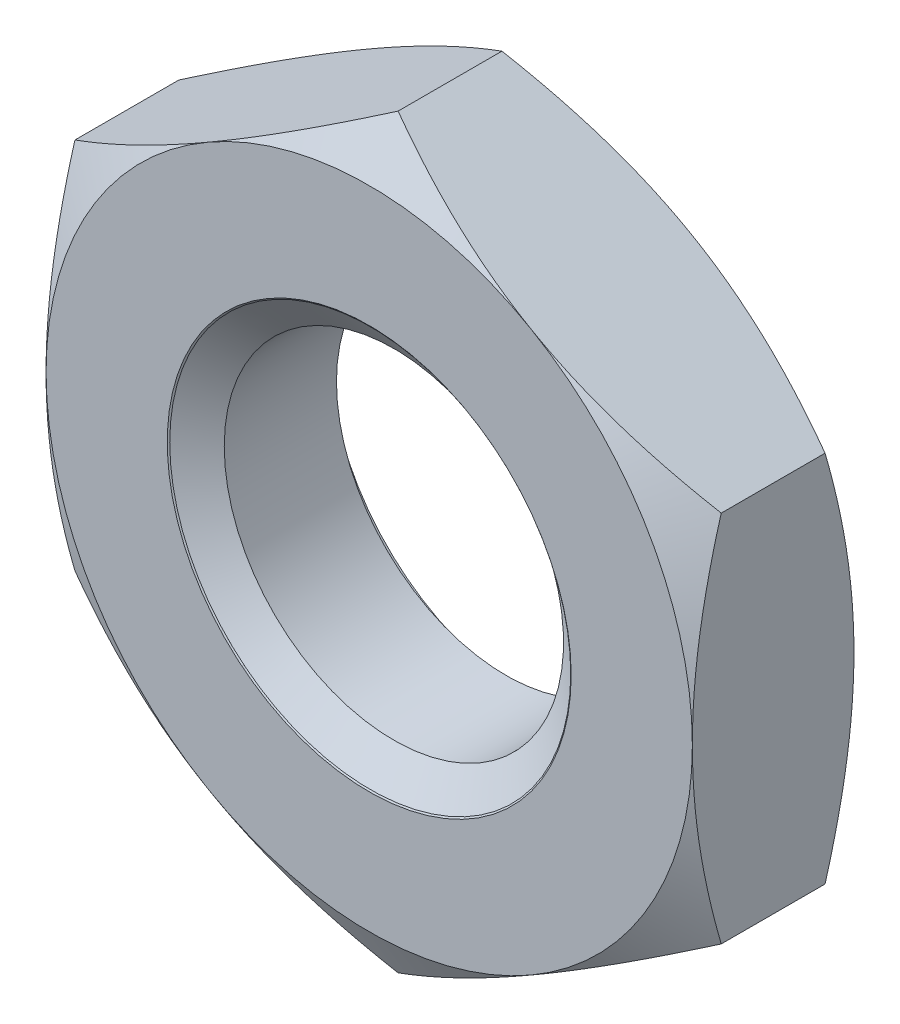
ISO-10303-21;
HEADER;
FILE_DESCRIPTION(('STEP AP214'),'2;1');
FILE_NAME('part.step','',(''),(''),'','','');
FILE_SCHEMA(('AUTOMOTIVE_DESIGN { 1 0 10303 214 1 1 1 1 }'));
ENDSEC;
DATA;
#1=APPLICATION_CONTEXT('core data for automotive mechanical design processes');
#2=APPLICATION_PROTOCOL_DEFINITION('international standard','automotive_design',2000,#1);
#3=PRODUCT_CONTEXT('',#1,'mechanical');
#4=PRODUCT('Part','Part','',(#3));
#5=PRODUCT_RELATED_PRODUCT_CATEGORY('part','',(#4));
#6=PRODUCT_DEFINITION_FORMATION('','',#4);
#7=PRODUCT_DEFINITION_CONTEXT('part definition',#1,'design');
#8=PRODUCT_DEFINITION('design','',#6,#7);
#9=PRODUCT_DEFINITION_SHAPE('','',#8);
#10=(LENGTH_UNIT() NAMED_UNIT(*) SI_UNIT(.MILLI.,.METRE.));
#11=(NAMED_UNIT(*) PLANE_ANGLE_UNIT() SI_UNIT($,.RADIAN.));
#12=(NAMED_UNIT(*) SI_UNIT($,.STERADIAN.) SOLID_ANGLE_UNIT());
#13=UNCERTAINTY_MEASURE_WITH_UNIT(LENGTH_MEASURE(1.E-05),#10,'distance_accuracy_value','');
#14=(GEOMETRIC_REPRESENTATION_CONTEXT(3) GLOBAL_UNCERTAINTY_ASSIGNED_CONTEXT((#13)) GLOBAL_UNIT_ASSIGNED_CONTEXT((#10,
#11,#12)) REPRESENTATION_CONTEXT('',''));
#15=CARTESIAN_POINT('',(0.,0.,0.));
#16=DIRECTION('',(0.,0.,1.));
#17=DIRECTION('',(1.,0.,0.));
#18=AXIS2_PLACEMENT_3D('',#15,#16,#17);
#19=CARTESIAN_POINT('',(0.,0.,-2.));
#20=DIRECTION('',(0.,0.,1.));
#21=DIRECTION('',(1.,0.,0.));
#22=AXIS2_PLACEMENT_3D('',#19,#20,#21);
#23=CYLINDRICAL_SURFACE('',#22,2.1);
#24=CARTESIAN_POINT('',(0.,0.,-0.305483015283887));
#25=DIRECTION('',(0.,0.,-1.));
#26=DIRECTION('',(-1.,0.,0.));
#27=AXIS2_PLACEMENT_3D('',#24,#25,#26);
#28=CIRCLE('',#27,2.1);
#29=CARTESIAN_POINT('',(-2.1,0.,-0.305483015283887));
#30=VERTEX_POINT('',#29);
#31=EDGE_CURVE('E302',#30,#30,#28,.T.);
#32=ORIENTED_EDGE('',*,*,#31,.F.);
#33=EDGE_LOOP('',(#32));
#34=FACE_BOUND('',#33,.T.);
#35=CARTESIAN_POINT('',(0.,0.,-1.69451698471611));
#36=DIRECTION('',(0.,0.,-1.));
#37=DIRECTION('',(-1.,0.,0.));
#38=AXIS2_PLACEMENT_3D('',#35,#36,#37);
#39=CIRCLE('',#38,2.1);
#40=CARTESIAN_POINT('',(-2.1,0.,-1.69451698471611));
#41=VERTEX_POINT('',#40);
#42=EDGE_CURVE('E173',#41,#41,#39,.F.);
#43=ORIENTED_EDGE('',*,*,#42,.F.);
#44=EDGE_LOOP('',(#43));
#45=FACE_BOUND('',#44,.T.);
#46=ADVANCED_FACE('F31',(#34,#45),#23,.F.);
#47=CARTESIAN_POINT('',(0.,4.61880215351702,-2.));
#48=DIRECTION('',(0.,0.,-1.));
#49=DIRECTION('',(-1.,0.,0.));
#50=AXIS2_PLACEMENT_3D('',#47,#48,#49);
#51=PLANE('',#50);
#52=CARTESIAN_POINT('',(0.,0.,-2.));
#53=DIRECTION('',(0.,0.,-1.));
#54=DIRECTION('',(-1.,0.,0.));
#55=AXIS2_PLACEMENT_3D('',#52,#53,#54);
#56=CIRCLE('',#55,4.);
#57=CARTESIAN_POINT('',(-4.,0.,-2.));
#58=VERTEX_POINT('',#57);
#59=CARTESIAN_POINT('',(-2.00000000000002,-3.46410161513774,-2.));
#60=VERTEX_POINT('',#59);
#61=EDGE_CURVE('E167',#58,#60,#56,.F.);
#62=ORIENTED_EDGE('',*,*,#61,.F.);
#63=CARTESIAN_POINT('',(-2.00000000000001,3.46410161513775,-2.));
#64=VERTEX_POINT('',#63);
#65=EDGE_CURVE('E149',#64,#58,#56,.F.);
#66=ORIENTED_EDGE('',*,*,#65,.F.);
#67=CARTESIAN_POINT('',(2.00000000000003,3.46410161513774,-2.));
#68=VERTEX_POINT('',#67);
#69=EDGE_CURVE('E166',#68,#64,#56,.F.);
#70=ORIENTED_EDGE('',*,*,#69,.F.);
#71=CARTESIAN_POINT('',(0.,0.,-2.));
#72=DIRECTION('',(0.,0.,1.));
#73=DIRECTION('',(1.,0.,0.));
#74=AXIS2_PLACEMENT_3D('',#71,#72,#73);
#75=CIRCLE('',#74,4.);
#76=CARTESIAN_POINT('',(4.,0.,-2.));
#77=VERTEX_POINT('',#76);
#78=EDGE_CURVE('E240',#77,#68,#75,.T.);
#79=ORIENTED_EDGE('',*,*,#78,.F.);
#80=CARTESIAN_POINT('',(2.00000000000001,-3.46410161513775,-2.));
#81=VERTEX_POINT('',#80);
#82=EDGE_CURVE('E533',#81,#77,#56,.F.);
#83=ORIENTED_EDGE('',*,*,#82,.F.);
#84=EDGE_CURVE('E536',#60,#81,#56,.F.);
#85=ORIENTED_EDGE('',*,*,#84,.F.);
#86=EDGE_LOOP('',(#62,#66,#70,#79,#83,#85));
#87=FACE_BOUND('',#86,.T.);
#88=CARTESIAN_POINT('',(0.,0.,-2.));
#89=DIRECTION('',(0.,0.,-1.));
#90=DIRECTION('',(-1.,0.,0.));
#91=AXIS2_PLACEMENT_3D('',#88,#89,#90);
#92=CIRCLE('',#91,2.5);
#93=CARTESIAN_POINT('',(-2.5,0.,-2.));
#94=VERTEX_POINT('',#93);
#95=EDGE_CURVE('E171',#94,#94,#92,.F.);
#96=ORIENTED_EDGE('',*,*,#95,.T.);
#97=EDGE_LOOP('',(#96));
#98=FACE_BOUND('',#97,.T.);
#99=ADVANCED_FACE('F293',(#87,#98),#51,.T.);
#100=CARTESIAN_POINT('',(0.,4.61880215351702,0.));
#101=DIRECTION('',(0.,0.,-1.));
#102=DIRECTION('',(-1.,0.,0.));
#103=AXIS2_PLACEMENT_3D('',#100,#101,#102);
#104=PLANE('',#103);
#105=CARTESIAN_POINT('',(0.,0.,0.));
#106=DIRECTION('',(0.,0.,-1.));
#107=DIRECTION('',(-1.,0.,0.));
#108=AXIS2_PLACEMENT_3D('',#105,#106,#107);
#109=CIRCLE('',#108,4.);
#110=CARTESIAN_POINT('',(-4.,0.,0.));
#111=VERTEX_POINT('',#110);
#112=CARTESIAN_POINT('',(-2.00000000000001,3.46410161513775,0.));
#113=VERTEX_POINT('',#112);
#114=EDGE_CURVE('E11',#111,#113,#109,.T.);
#115=ORIENTED_EDGE('',*,*,#114,.F.);
#116=CARTESIAN_POINT('',(-2.00000000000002,-3.46410161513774,0.));
#117=VERTEX_POINT('',#116);
#118=EDGE_CURVE('E43',#117,#111,#109,.T.);
#119=ORIENTED_EDGE('',*,*,#118,.F.);
#120=CARTESIAN_POINT('',(2.00000000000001,-3.46410161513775,0.));
#121=VERTEX_POINT('',#120);
#122=EDGE_CURVE('E170',#121,#117,#109,.T.);
#123=ORIENTED_EDGE('',*,*,#122,.F.);
#124=CARTESIAN_POINT('',(4.,0.,0.));
#125=VERTEX_POINT('',#124);
#126=EDGE_CURVE('E526',#125,#121,#109,.T.);
#127=ORIENTED_EDGE('',*,*,#126,.F.);
#128=CARTESIAN_POINT('',(0.,0.,0.));
#129=DIRECTION('',(0.,0.,1.));
#130=DIRECTION('',(1.,0.,0.));
#131=AXIS2_PLACEMENT_3D('',#128,#129,#130);
#132=CIRCLE('',#131,4.);
#133=CARTESIAN_POINT('',(2.00000000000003,3.46410161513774,0.));
#134=VERTEX_POINT('',#133);
#135=EDGE_CURVE('E125',#125,#134,#132,.T.);
#136=ORIENTED_EDGE('',*,*,#135,.T.);
#137=EDGE_CURVE('E41',#113,#134,#109,.T.);
#138=ORIENTED_EDGE('',*,*,#137,.F.);
#139=EDGE_LOOP('',(#115,#119,#123,#127,#136,#138));
#140=FACE_BOUND('',#139,.T.);
#141=CARTESIAN_POINT('',(0.,0.,0.));
#142=DIRECTION('',(0.,0.,1.));
#143=DIRECTION('',(1.,0.,0.));
#144=AXIS2_PLACEMENT_3D('',#141,#142,#143);
#145=CIRCLE('',#144,2.5);
#146=CARTESIAN_POINT('',(2.5,0.,0.));
#147=VERTEX_POINT('',#146);
#148=EDGE_CURVE('E176',#147,#147,#145,.T.);
#149=ORIENTED_EDGE('',*,*,#148,.F.);
#150=EDGE_LOOP('',(#149));
#151=FACE_BOUND('',#150,.T.);
#152=ADVANCED_FACE('F245',(#140,#151),#104,.F.);
#153=CARTESIAN_POINT('',(0.,4.61880215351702,-2.));
#154=DIRECTION('',(-0.500000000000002,0.866025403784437,0.));
#155=DIRECTION('',(-0.866025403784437,-0.500000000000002,0.));
#156=AXIS2_PLACEMENT_3D('',#153,#154,#155);
#157=PLANE('',#156);
#158=DIRECTION('',(0.,0.,1.));
#159=VECTOR('',#158,1.);
#160=CARTESIAN_POINT('',(-4.,2.3094010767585,-2.));
#161=LINE('',#160,#159);
#162=CARTESIAN_POINT('',(-4.,2.30940107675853,-1.64273441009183));
#163=VERTEX_POINT('',#162);
#164=CARTESIAN_POINT('',(-4.,2.3094010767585,-0.357265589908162));
#165=VERTEX_POINT('',#164);
#166=EDGE_CURVE('E161',#163,#165,#161,.T.);
#167=ORIENTED_EDGE('',*,*,#166,.T.);
#168=CARTESIAN_POINT('',(-4.0002,2.30928560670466,-0.357332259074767));
#169=CARTESIAN_POINT('',(-3.82442084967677,2.4107717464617,-0.298717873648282));
#170=CARTESIAN_POINT('',(-3.64712438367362,2.51313390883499,-0.245410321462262));
#171=CARTESIAN_POINT('',(-3.28946140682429,2.71963072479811,-0.152361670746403));
#172=CARTESIAN_POINT('',(-3.10908854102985,2.82376904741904,-0.112653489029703));
#173=CARTESIAN_POINT('',(-2.75057818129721,3.03075510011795,-0.0508422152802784));
#174=CARTESIAN_POINT('',(-2.57249584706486,3.13357098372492,-0.0283277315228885));
#175=CARTESIAN_POINT('',(-2.21549328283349,3.33968651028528,-0.00145062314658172));
#176=CARTESIAN_POINT('',(-2.0365743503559,3.44298540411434,0.00293425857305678));
#177=CARTESIAN_POINT('',(-1.70225715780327,3.63600352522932,-0.00619007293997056));
#178=CARTESIAN_POINT('',(-1.54680884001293,3.72575165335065,-0.0174589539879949));
#179=CARTESIAN_POINT('',(-1.23692494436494,3.90466320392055,-0.053173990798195));
#180=CARTESIAN_POINT('',(-1.08249043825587,3.99382600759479,-0.0776323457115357));
#181=CARTESIAN_POINT('',(-0.771967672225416,4.17310641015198,-0.138776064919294));
#182=CARTESIAN_POINT('',(-0.615918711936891,4.26320131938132,-0.175720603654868));
#183=CARTESIAN_POINT('',(-0.306148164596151,4.44204742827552,-0.259570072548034));
#184=CARTESIAN_POINT('',(-0.152422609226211,4.53080091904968,-0.306455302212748));
#185=CARTESIAN_POINT('',(0.000200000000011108,4.61891762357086,-0.357332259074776));
#186=B_SPLINE_CURVE_WITH_KNOTS('',3,(#168,#169,#170,#171,#172,#173,#174,#175,#176,#177,#178,
#179,#180,#181,#182,#183,#184,#185),.UNSPECIFIED.,.F.,.F.,(4,2,2,2,2,2,2,2,4),(0.,
0.634047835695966,1.26961969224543,1.88946157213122,2.50854226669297,3.04757825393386,
3.58711366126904,4.13861653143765,4.68903648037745),.UNSPECIFIED.);
#187=EDGE_CURVE('E130',#165,#113,#186,.T.);
#188=ORIENTED_EDGE('',*,*,#187,.T.);
#189=CARTESIAN_POINT('',(0.,4.61880215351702,-0.357265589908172));
#190=VERTEX_POINT('',#189);
#191=EDGE_CURVE('E50',#113,#190,#186,.T.);
#192=ORIENTED_EDGE('',*,*,#191,.T.);
#193=DIRECTION('',(0.,0.,1.));
#194=VECTOR('',#193,1.);
#195=CARTESIAN_POINT('',(0.,4.61880215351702,-2.));
#196=LINE('',#195,#194);
#197=CARTESIAN_POINT('',(0.,4.61880215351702,-1.64273441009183));
#198=VERTEX_POINT('',#197);
#199=EDGE_CURVE('E146',#198,#190,#196,.T.);
#200=ORIENTED_EDGE('',*,*,#199,.F.);
#201=CARTESIAN_POINT('',(-4.0002,2.30928560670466,-1.64266774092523));
#202=CARTESIAN_POINT('',(-3.82442084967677,2.4107717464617,-1.70128212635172));
#203=CARTESIAN_POINT('',(-3.64712438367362,2.51313390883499,-1.75458967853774));
#204=CARTESIAN_POINT('',(-3.28946140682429,2.71963072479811,-1.8476383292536));
#205=CARTESIAN_POINT('',(-3.10908854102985,2.82376904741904,-1.8873465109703));
#206=CARTESIAN_POINT('',(-2.75057818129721,3.03075510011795,-1.94915778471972));
#207=CARTESIAN_POINT('',(-2.57249584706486,3.13357098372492,-1.97167226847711));
#208=CARTESIAN_POINT('',(-2.21549328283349,3.33968651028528,-1.99854937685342));
#209=CARTESIAN_POINT('',(-2.0365743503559,3.44298540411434,-2.00293425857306));
#210=CARTESIAN_POINT('',(-1.70225715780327,3.63600352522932,-1.99380992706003));
#211=CARTESIAN_POINT('',(-1.54680884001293,3.72575165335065,-1.982541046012));
#212=CARTESIAN_POINT('',(-1.23692494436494,3.90466320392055,-1.9468260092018));
#213=CARTESIAN_POINT('',(-1.08249043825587,3.99382600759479,-1.92236765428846));
#214=CARTESIAN_POINT('',(-0.771967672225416,4.17310641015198,-1.86122393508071));
#215=CARTESIAN_POINT('',(-0.615918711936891,4.26320131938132,-1.82427939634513));
#216=CARTESIAN_POINT('',(-0.306148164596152,4.44204742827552,-1.74042992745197));
#217=CARTESIAN_POINT('',(-0.15242260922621,4.53080091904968,-1.69354469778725));
#218=CARTESIAN_POINT('',(0.000200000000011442,4.61891762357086,-1.64266774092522));
#219=B_SPLINE_CURVE_WITH_KNOTS('',3,(#201,#202,#203,#204,#205,#206,#207,#208,#209,#210,#211,
#212,#213,#214,#215,#216,#217,#218),.UNSPECIFIED.,.F.,.F.,(4,2,2,2,2,2,2,2,4),(0.,
0.634047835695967,1.26961969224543,1.88946157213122,2.50854226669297,3.04757825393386,
3.58711366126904,4.13861653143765,4.68903648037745),.UNSPECIFIED.);
#220=EDGE_CURVE('E164',#64,#198,#219,.T.);
#221=ORIENTED_EDGE('',*,*,#220,.F.);
#222=EDGE_CURVE('E255',#163,#64,#219,.T.);
#223=ORIENTED_EDGE('',*,*,#222,.F.);
#224=EDGE_LOOP('',(#167,#188,#192,#200,#221,#223));
#225=FACE_BOUND('',#224,.T.);
#226=ADVANCED_FACE('F33',(#225),#157,.T.);
#227=CARTESIAN_POINT('',(4.,2.30940107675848,-2.));
#228=DIRECTION('',(0.500000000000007,0.866025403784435,0.));
#229=DIRECTION('',(-0.866025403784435,0.500000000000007,0.));
#230=AXIS2_PLACEMENT_3D('',#227,#228,#229);
#231=PLANE('',#230);
#232=ORIENTED_EDGE('',*,*,#199,.T.);
#233=CARTESIAN_POINT('',(-0.00019999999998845,4.61891762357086,-0.357332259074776));
#234=CARTESIAN_POINT('',(0.175579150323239,4.51743148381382,-0.298717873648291));
#235=CARTESIAN_POINT('',(0.352875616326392,4.41506932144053,-0.24541032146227));
#236=CARTESIAN_POINT('',(0.710538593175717,4.2085725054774,-0.152361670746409));
#237=CARTESIAN_POINT('',(0.890911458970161,4.10443418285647,-0.112653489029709));
#238=CARTESIAN_POINT('',(1.2494218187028,3.89744813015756,-0.0508422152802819));
#239=CARTESIAN_POINT('',(1.42750415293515,3.79463224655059,-0.028327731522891));
#240=CARTESIAN_POINT('',(1.78450671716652,3.58851671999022,-0.00145062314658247));
#241=CARTESIAN_POINT('',(1.96342564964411,3.48521782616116,0.00293425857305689));
#242=CARTESIAN_POINT('',(2.29774284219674,3.29219970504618,-0.00619007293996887));
#243=CARTESIAN_POINT('',(2.45319115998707,3.20245157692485,-0.0174589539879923));
#244=CARTESIAN_POINT('',(2.76307505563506,3.02354002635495,-0.0531739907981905));
#245=CARTESIAN_POINT('',(2.91750956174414,2.93437722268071,-0.0776323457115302));
#246=CARTESIAN_POINT('',(3.22803232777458,2.75509682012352,-0.138776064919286));
#247=CARTESIAN_POINT('',(3.38408128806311,2.66500191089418,-0.17572060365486));
#248=CARTESIAN_POINT('',(3.69385183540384,2.48615580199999,-0.259570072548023));
#249=CARTESIAN_POINT('',(3.84757739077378,2.39740231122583,-0.306455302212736));
#250=CARTESIAN_POINT('',(4.0002,2.30928560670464,-0.357332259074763));
#251=B_SPLINE_CURVE_WITH_KNOTS('',3,(#233,#234,#235,#236,#237,#238,#239,#240,#241,#242,#243,
#244,#245,#246,#247,#248,#249,#250),.UNSPECIFIED.,.F.,.F.,(4,2,2,2,2,2,2,2,4),(0.,
0.634047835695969,1.26961969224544,1.88946157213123,2.50854226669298,3.04757825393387,
3.58711366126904,4.13861653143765,4.68903648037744),.UNSPECIFIED.);
#252=EDGE_CURVE('E140',#190,#134,#251,.T.);
#253=ORIENTED_EDGE('',*,*,#252,.T.);
#254=CARTESIAN_POINT('',(4.,2.30940107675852,-0.357265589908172));
#255=VERTEX_POINT('',#254);
#256=EDGE_CURVE('E57',#134,#255,#251,.T.);
#257=ORIENTED_EDGE('',*,*,#256,.T.);
#258=DIRECTION('',(0.,0.,1.));
#259=VECTOR('',#258,1.);
#260=CARTESIAN_POINT('',(4.,2.30940107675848,-2.));
#261=LINE('',#260,#259);
#262=CARTESIAN_POINT('',(4.,2.30940107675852,-1.64273441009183));
#263=VERTEX_POINT('',#262);
#264=EDGE_CURVE('E139',#263,#255,#261,.T.);
#265=ORIENTED_EDGE('',*,*,#264,.F.);
#266=CARTESIAN_POINT('',(-0.00019999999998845,4.61891762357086,-1.64266774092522));
#267=CARTESIAN_POINT('',(0.17557915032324,4.51743148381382,-1.70128212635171));
#268=CARTESIAN_POINT('',(0.352875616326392,4.41506932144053,-1.75458967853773));
#269=CARTESIAN_POINT('',(0.710538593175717,4.2085725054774,-1.84763832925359));
#270=CARTESIAN_POINT('',(0.890911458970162,4.10443418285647,-1.88734651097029));
#271=CARTESIAN_POINT('',(1.2494218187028,3.89744813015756,-1.94915778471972));
#272=CARTESIAN_POINT('',(1.42750415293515,3.79463224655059,-1.97167226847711));
#273=CARTESIAN_POINT('',(1.78450671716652,3.58851671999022,-1.99854937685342));
#274=CARTESIAN_POINT('',(1.96342564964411,3.48521782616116,-2.00293425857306));
#275=CARTESIAN_POINT('',(2.29774284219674,3.29219970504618,-1.99380992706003));
#276=CARTESIAN_POINT('',(2.45319115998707,3.20245157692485,-1.98254104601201));
#277=CARTESIAN_POINT('',(2.76307505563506,3.02354002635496,-1.94682600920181));
#278=CARTESIAN_POINT('',(2.91750956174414,2.93437722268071,-1.92236765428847));
#279=CARTESIAN_POINT('',(3.22803232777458,2.75509682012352,-1.86122393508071));
#280=CARTESIAN_POINT('',(3.38408128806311,2.66500191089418,-1.82427939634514));
#281=CARTESIAN_POINT('',(3.69385183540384,2.48615580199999,-1.74042992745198));
#282=CARTESIAN_POINT('',(3.84757739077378,2.39740231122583,-1.69354469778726));
#283=CARTESIAN_POINT('',(4.0002,2.30928560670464,-1.64266774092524));
#284=B_SPLINE_CURVE_WITH_KNOTS('',3,(#266,#267,#268,#269,#270,#271,#272,#273,#274,#275,#276,
#277,#278,#279,#280,#281,#282,#283),.UNSPECIFIED.,.F.,.F.,(4,2,2,2,2,2,2,2,4),(0.,
0.634047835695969,1.26961969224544,1.88946157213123,2.50854226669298,3.04757825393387,
3.58711366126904,4.13861653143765,4.68903648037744),.UNSPECIFIED.);
#285=EDGE_CURVE('E249',#68,#263,#284,.T.);
#286=ORIENTED_EDGE('',*,*,#285,.F.);
#287=EDGE_CURVE('E254',#198,#68,#284,.T.);
#288=ORIENTED_EDGE('',*,*,#287,.F.);
#289=EDGE_LOOP('',(#232,#253,#257,#265,#286,#288));
#290=FACE_BOUND('',#289,.T.);
#291=ADVANCED_FACE('F137',(#290),#231,.T.);
#292=CARTESIAN_POINT('',(4.,2.30940107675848,-2.));
#293=DIRECTION('',(-1.,0.,0.));
#294=DIRECTION('',(0.,0.,1.));
#295=AXIS2_PLACEMENT_3D('',#292,#293,#294);
#296=PLANE('',#295);
#297=CARTESIAN_POINT('',(4.,-6.12487198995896,-1.91410682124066));
#298=CARTESIAN_POINT('',(4.,-5.9492493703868,-1.82923627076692));
#299=CARTESIAN_POINT('',(4.,-5.7732115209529,-1.74520940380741));
#300=CARTESIAN_POINT('',(4.,-5.42008084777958,-1.57932514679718));
#301=CARTESIAN_POINT('',(4.,-5.24298784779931,-1.49746813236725));
#302=CARTESIAN_POINT('',(4.,-4.88656571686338,-1.33597446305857));
#303=CARTESIAN_POINT('',(4.,-4.70722958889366,-1.25635319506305));
#304=CARTESIAN_POINT('',(4.,-4.34708334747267,-1.10053058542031));
#305=CARTESIAN_POINT('',(4.,-4.16627331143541,-1.02432906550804));
#306=CARTESIAN_POINT('',(4.,-3.80064706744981,-0.875350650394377));
#307=CARTESIAN_POINT('',(4.,-3.61580892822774,-0.80262728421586));
#308=CARTESIAN_POINT('',(4.,-3.24395246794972,-0.662876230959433));
#309=CARTESIAN_POINT('',(4.,-3.05693390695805,-0.595849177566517));
#310=CARTESIAN_POINT('',(4.,-2.68080318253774,-0.469291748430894));
#311=CARTESIAN_POINT('',(4.,-2.49169643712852,-0.409745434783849));
#312=CARTESIAN_POINT('',(4.,-2.11079454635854,-0.300083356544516));
#313=CARTESIAN_POINT('',(4.,-1.91900027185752,-0.249964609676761));
#314=CARTESIAN_POINT('',(4.,-1.53259232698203,-0.161590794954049));
#315=CARTESIAN_POINT('',(4.,-1.33797792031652,-0.123338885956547));
#316=CARTESIAN_POINT('',(4.,-0.94640272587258,-0.0612742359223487));
#317=CARTESIAN_POINT('',(4.,-0.749441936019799,-0.0374615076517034));
#318=CARTESIAN_POINT('',(4.,-0.355451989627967,-0.00638181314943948));
#319=CARTESIAN_POINT('',(4.,-0.158431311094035,0.000989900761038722));
#320=CARTESIAN_POINT('',(4.,0.235472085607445,-0.00120406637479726));
#321=CARTESIAN_POINT('',(4.,0.432354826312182,-0.0107653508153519));
#322=CARTESIAN_POINT('',(4.,0.768560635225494,-0.0408787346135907));
#323=CARTESIAN_POINT('',(4.,0.908254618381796,-0.0575092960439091));
#324=CARTESIAN_POINT('',(4.,1.18656349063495,-0.0982134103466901));
#325=CARTESIAN_POINT('',(4.,1.32517820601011,-0.122288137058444));
#326=CARTESIAN_POINT('',(4.,1.73929045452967,-0.204415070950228));
#327=CARTESIAN_POINT('',(4.,2.0128469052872,-0.272348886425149));
#328=CARTESIAN_POINT('',(4.,2.42218253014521,-0.389516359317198));
#329=CARTESIAN_POINT('',(4.,2.56009536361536,-0.43171394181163));
#330=CARTESIAN_POINT('',(4.,2.83448159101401,-0.520284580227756));
#331=CARTESIAN_POINT('',(4.,2.97095590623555,-0.566654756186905));
#332=CARTESIAN_POINT('',(4.,3.24189440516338,-0.662605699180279));
#333=CARTESIAN_POINT('',(4.,3.37636557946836,-0.712166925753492));
#334=CARTESIAN_POINT('',(4.,3.64426461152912,-0.814198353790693));
#335=CARTESIAN_POINT('',(4.,3.77769202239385,-0.866669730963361));
#336=CARTESIAN_POINT('',(4.,3.91063698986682,-0.920309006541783));
#337=B_SPLINE_CURVE_WITH_KNOTS('',3,(#297,#298,#299,#300,#301,#302,#303,#304,#305,#306,#307,
#308,#309,#310,#311,#312,#313,#314,#315,#316,#317,#318,#319,#320,#321,#322,#323,#324,#325,#326,
#327,#328,#329,#330,#331,#332,#333,#334,#335,#336),.UNSPECIFIED.,.F.,.F.,(4,2,2,2,2,2,2,2,2,2,2,
2,2,2,2,2,2,2,2,4),(0.,0.585171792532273,1.17044423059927,1.7590659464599,2.34765694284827,
2.94347400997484,3.5393572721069,4.13394864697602,4.72835161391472,5.32291267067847,
5.91747425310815,6.50823685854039,7.09884609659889,7.52068140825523,7.94258327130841,
8.78701491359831,9.21965281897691,9.65199437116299,10.0819024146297,10.5119854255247),.UNSPECIFIED.);
#338=CARTESIAN_POINT('',(3.99999999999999,-2.30940107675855,-0.357265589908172));
#339=VERTEX_POINT('',#338);
#340=EDGE_CURVE('E132',#339,#125,#337,.T.);
#341=ORIENTED_EDGE('',*,*,#340,.F.);
#342=DIRECTION('',(0.,0.,1.));
#343=VECTOR('',#342,1.);
#344=CARTESIAN_POINT('',(4.,-2.30940107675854,-2.));
#345=LINE('',#344,#343);
#346=CARTESIAN_POINT('',(3.99999999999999,-2.30940107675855,-1.64273441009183));
#347=VERTEX_POINT('',#346);
#348=EDGE_CURVE('E147',#347,#339,#345,.T.);
#349=ORIENTED_EDGE('',*,*,#348,.F.);
#350=CARTESIAN_POINT('',(4.,-6.12487198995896,-0.0858931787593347));
#351=CARTESIAN_POINT('',(4.,-5.9492493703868,-0.170763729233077));
#352=CARTESIAN_POINT('',(4.,-5.7732115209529,-0.254790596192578));
#353=CARTESIAN_POINT('',(4.,-5.42008084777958,-0.420674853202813));
#354=CARTESIAN_POINT('',(4.,-5.24298784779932,-0.502531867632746));
#355=CARTESIAN_POINT('',(4.,-4.88656571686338,-0.664025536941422));
#356=CARTESIAN_POINT('',(4.,-4.70722958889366,-0.743646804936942));
#357=CARTESIAN_POINT('',(4.,-4.34708334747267,-0.899469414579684));
#358=CARTESIAN_POINT('',(4.,-4.16627331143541,-0.975670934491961));
#359=CARTESIAN_POINT('',(4.,-3.80064706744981,-1.12464934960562));
#360=CARTESIAN_POINT('',(4.,-3.61580892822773,-1.19737271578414));
#361=CARTESIAN_POINT('',(4.,-3.24395246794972,-1.33712376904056));
#362=CARTESIAN_POINT('',(4.,-3.05693390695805,-1.40415082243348));
#363=CARTESIAN_POINT('',(4.,-2.68080318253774,-1.5307082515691));
#364=CARTESIAN_POINT('',(4.,-2.49169643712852,-1.59025456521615));
#365=CARTESIAN_POINT('',(4.,-2.11079454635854,-1.69991664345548));
#366=CARTESIAN_POINT('',(4.,-1.91900027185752,-1.75003539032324));
#367=CARTESIAN_POINT('',(4.,-1.53259232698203,-1.83840920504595));
#368=CARTESIAN_POINT('',(4.,-1.33797792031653,-1.87666111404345));
#369=CARTESIAN_POINT('',(4.,-0.946402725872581,-1.93872576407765));
#370=CARTESIAN_POINT('',(4.,-0.749441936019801,-1.9625384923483));
#371=CARTESIAN_POINT('',(4.,-0.355451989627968,-1.99361818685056));
#372=CARTESIAN_POINT('',(4.,-0.158431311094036,-2.00098990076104));
#373=CARTESIAN_POINT('',(4.,0.235472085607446,-1.9987959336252));
#374=CARTESIAN_POINT('',(4.,0.432354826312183,-1.98923464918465));
#375=CARTESIAN_POINT('',(4.,0.768560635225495,-1.95912126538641));
#376=CARTESIAN_POINT('',(4.,0.908254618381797,-1.94249070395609));
#377=CARTESIAN_POINT('',(4.,1.18656349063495,-1.90178658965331));
#378=CARTESIAN_POINT('',(4.,1.32517820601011,-1.87771186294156));
#379=CARTESIAN_POINT('',(4.,1.73929045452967,-1.79558492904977));
#380=CARTESIAN_POINT('',(4.,2.01284690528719,-1.72765111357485));
#381=CARTESIAN_POINT('',(4.,2.42218253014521,-1.6104836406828));
#382=CARTESIAN_POINT('',(4.,2.56009536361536,-1.56828605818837));
#383=CARTESIAN_POINT('',(4.,2.83448159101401,-1.47971541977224));
#384=CARTESIAN_POINT('',(4.,2.97095590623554,-1.4333452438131));
#385=CARTESIAN_POINT('',(4.,3.24189440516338,-1.33739430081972));
#386=CARTESIAN_POINT('',(4.,3.37636557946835,-1.28783307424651));
#387=CARTESIAN_POINT('',(4.,3.6442646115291,-1.18580164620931));
#388=CARTESIAN_POINT('',(4.,3.77769202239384,-1.13333026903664));
#389=CARTESIAN_POINT('',(4.,3.91063698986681,-1.07969099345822));
#390=B_SPLINE_CURVE_WITH_KNOTS('',3,(#350,#351,#352,#353,#354,#355,#356,#357,#358,#359,#360,
#361,#362,#363,#364,#365,#366,#367,#368,#369,#370,#371,#372,#373,#374,#375,#376,#377,#378,#379,
#380,#381,#382,#383,#384,#385,#386,#387,#388,#389),.UNSPECIFIED.,.F.,.F.,(4,2,2,2,2,2,2,2,2,2,2,
2,2,2,2,2,2,2,2,4),(0.,0.585171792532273,1.17044423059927,1.7590659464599,2.34765694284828,
2.94347400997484,3.5393572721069,4.13394864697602,4.72835161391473,5.32291267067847,
5.91747425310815,6.50823685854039,7.09884609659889,7.52068140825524,7.94258327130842,
8.78701491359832,9.21965281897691,9.65199437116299,10.0819024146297,10.5119854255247),.UNSPECIFIED.);
#391=EDGE_CURVE('E261',#347,#77,#390,.T.);
#392=ORIENTED_EDGE('',*,*,#391,.T.);
#393=EDGE_CURVE('E145',#77,#263,#390,.T.);
#394=ORIENTED_EDGE('',*,*,#393,.T.);
#395=ORIENTED_EDGE('',*,*,#264,.T.);
#396=EDGE_CURVE('E122',#125,#255,#337,.T.);
#397=ORIENTED_EDGE('',*,*,#396,.F.);
#398=EDGE_LOOP('',(#341,#349,#392,#394,#395,#397));
#399=FACE_BOUND('',#398,.T.);
#400=ADVANCED_FACE('F143',(#399),#296,.F.);
#401=CARTESIAN_POINT('',(0.,-4.61880215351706,-2.));
#402=DIRECTION('',(0.500000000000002,-0.866025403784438,0.));
#403=DIRECTION('',(0.866025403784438,0.500000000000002,0.));
#404=AXIS2_PLACEMENT_3D('',#401,#402,#403);
#405=PLANE('',#404);
#406=ORIENTED_EDGE('',*,*,#348,.T.);
#407=CARTESIAN_POINT('',(4.0002,-2.3092856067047,-0.35733225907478));
#408=CARTESIAN_POINT('',(3.82442084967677,-2.41077174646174,-0.298717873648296));
#409=CARTESIAN_POINT('',(3.64712438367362,-2.51313390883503,-0.245410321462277));
#410=CARTESIAN_POINT('',(3.28946140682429,-2.71963072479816,-0.152361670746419));
#411=CARTESIAN_POINT('',(3.10908854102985,-2.82376904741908,-0.11265348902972));
#412=CARTESIAN_POINT('',(2.75057818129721,-3.03075510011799,-0.0508422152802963));
#413=CARTESIAN_POINT('',(2.57249584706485,-3.13357098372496,-0.0283277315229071));
#414=CARTESIAN_POINT('',(2.21549328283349,-3.33968651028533,-0.00145062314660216));
#415=CARTESIAN_POINT('',(2.03657435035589,-3.44298540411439,0.00293425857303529));
#416=CARTESIAN_POINT('',(1.70225715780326,-3.63600352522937,-0.00619007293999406));
#417=CARTESIAN_POINT('',(1.54680884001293,-3.7257516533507,-0.0174589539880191));
#418=CARTESIAN_POINT('',(1.23692494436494,-3.90466320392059,-0.0531739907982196));
#419=CARTESIAN_POINT('',(1.08249043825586,-3.99382600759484,-0.07763234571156));
#420=CARTESIAN_POINT('',(0.771967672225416,-4.17310641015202,-0.138776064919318));
#421=CARTESIAN_POINT('',(0.615918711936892,-4.26320131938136,-0.175720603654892));
#422=CARTESIAN_POINT('',(0.306148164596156,-4.44204742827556,-0.259570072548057));
#423=CARTESIAN_POINT('',(0.152422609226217,-4.53080091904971,-0.306455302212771));
#424=CARTESIAN_POINT('',(-0.000200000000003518,-4.6189176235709,-0.357332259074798));
#425=B_SPLINE_CURVE_WITH_KNOTS('',3,(#407,#408,#409,#410,#411,#412,#413,#414,#415,#416,#417,
#418,#419,#420,#421,#422,#423,#424),.UNSPECIFIED.,.F.,.F.,(4,2,2,2,2,2,2,2,4),(0.,
0.63404783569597,1.26961969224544,1.88946157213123,2.50854226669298,3.04757825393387,
3.58711366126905,4.13861653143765,4.68903648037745),.UNSPECIFIED.);
#426=EDGE_CURVE('E522',#339,#121,#425,.T.);
#427=ORIENTED_EDGE('',*,*,#426,.T.);
#428=CARTESIAN_POINT('',(0.,-4.61880215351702,-0.357265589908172));
#429=VERTEX_POINT('',#428);
#430=EDGE_CURVE('E221',#121,#429,#425,.T.);
#431=ORIENTED_EDGE('',*,*,#430,.T.);
#432=DIRECTION('',(0.,0.,1.));
#433=VECTOR('',#432,1.);
#434=CARTESIAN_POINT('',(0.,-4.61880215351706,-2.));
#435=LINE('',#434,#433);
#436=CARTESIAN_POINT('',(0.,-4.61880215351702,-1.64273441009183));
#437=VERTEX_POINT('',#436);
#438=EDGE_CURVE('E152',#437,#429,#435,.T.);
#439=ORIENTED_EDGE('',*,*,#438,.F.);
#440=CARTESIAN_POINT('',(4.0002,-2.3092856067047,-1.64266774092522));
#441=CARTESIAN_POINT('',(3.82442084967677,-2.41077174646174,-1.7012821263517));
#442=CARTESIAN_POINT('',(3.64712438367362,-2.51313390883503,-1.75458967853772));
#443=CARTESIAN_POINT('',(3.28946140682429,-2.71963072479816,-1.84763832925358));
#444=CARTESIAN_POINT('',(3.10908854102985,-2.82376904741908,-1.88734651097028));
#445=CARTESIAN_POINT('',(2.75057818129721,-3.03075510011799,-1.9491577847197));
#446=CARTESIAN_POINT('',(2.57249584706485,-3.13357098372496,-1.97167226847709));
#447=CARTESIAN_POINT('',(2.21549328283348,-3.33968651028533,-1.9985493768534));
#448=CARTESIAN_POINT('',(2.03657435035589,-3.44298540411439,-2.00293425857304));
#449=CARTESIAN_POINT('',(1.70225715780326,-3.63600352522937,-1.99380992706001));
#450=CARTESIAN_POINT('',(1.54680884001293,-3.7257516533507,-1.98254104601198));
#451=CARTESIAN_POINT('',(1.23692494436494,-3.90466320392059,-1.94682600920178));
#452=CARTESIAN_POINT('',(1.08249043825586,-3.99382600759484,-1.92236765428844));
#453=CARTESIAN_POINT('',(0.771967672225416,-4.17310641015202,-1.86122393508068));
#454=CARTESIAN_POINT('',(0.615918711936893,-4.26320131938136,-1.82427939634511));
#455=CARTESIAN_POINT('',(0.306148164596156,-4.44204742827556,-1.74042992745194));
#456=CARTESIAN_POINT('',(0.152422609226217,-4.53080091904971,-1.69354469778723));
#457=CARTESIAN_POINT('',(-0.000200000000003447,-4.6189176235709,-1.6426677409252));
#458=B_SPLINE_CURVE_WITH_KNOTS('',3,(#440,#441,#442,#443,#444,#445,#446,#447,#448,#449,#450,
#451,#452,#453,#454,#455,#456,#457),.UNSPECIFIED.,.F.,.F.,(4,2,2,2,2,2,2,2,4),(0.,
0.634047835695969,1.26961969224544,1.88946157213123,2.50854226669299,3.04757825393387,
3.58711366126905,4.13861653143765,4.68903648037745),.UNSPECIFIED.);
#459=EDGE_CURVE('E267',#81,#437,#458,.T.);
#460=ORIENTED_EDGE('',*,*,#459,.F.);
#461=EDGE_CURVE('E266',#347,#81,#458,.T.);
#462=ORIENTED_EDGE('',*,*,#461,.F.);
#463=EDGE_LOOP('',(#406,#427,#431,#439,#460,#462));
#464=FACE_BOUND('',#463,.T.);
#465=ADVANCED_FACE('F277',(#464),#405,.T.);
#466=CARTESIAN_POINT('',(-4.,-2.30940107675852,-2.));
#467=DIRECTION('',(-0.500000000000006,-0.866025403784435,0.));
#468=DIRECTION('',(0.866025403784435,-0.500000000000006,0.));
#469=AXIS2_PLACEMENT_3D('',#466,#467,#468);
#470=PLANE('',#469);
#471=ORIENTED_EDGE('',*,*,#438,.T.);
#472=CARTESIAN_POINT('',(0.000199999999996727,-4.6189176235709,-0.357332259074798));
#473=CARTESIAN_POINT('',(-0.175579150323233,-4.51743148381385,-0.298717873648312));
#474=CARTESIAN_POINT('',(-0.352875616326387,-4.41506932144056,-0.245410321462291));
#475=CARTESIAN_POINT('',(-0.710538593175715,-4.20857250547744,-0.152361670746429));
#476=CARTESIAN_POINT('',(-0.89091145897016,-4.10443418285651,-0.112653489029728));
#477=CARTESIAN_POINT('',(-1.2494218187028,-3.89744813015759,-0.0508422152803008));
#478=CARTESIAN_POINT('',(-1.42750415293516,-3.79463224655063,-0.0283277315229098));
#479=CARTESIAN_POINT('',(-1.78450671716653,-3.58851671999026,-0.0014506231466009));
#480=CARTESIAN_POINT('',(-1.96342564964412,-3.4852178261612,0.00293425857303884));
#481=CARTESIAN_POINT('',(-2.29774284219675,-3.29219970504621,-0.0061900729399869));
#482=CARTESIAN_POINT('',(-2.45319115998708,-3.20245157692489,-0.0174589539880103));
#483=CARTESIAN_POINT('',(-2.76307505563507,-3.02354002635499,-0.0531739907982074));
#484=CARTESIAN_POINT('',(-2.91750956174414,-2.93437722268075,-0.0776323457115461));
#485=CARTESIAN_POINT('',(-3.22803232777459,-2.75509682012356,-0.1387760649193));
#486=CARTESIAN_POINT('',(-3.38408128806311,-2.66500191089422,-0.175720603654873));
#487=CARTESIAN_POINT('',(-3.69385183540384,-2.48615580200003,-0.259570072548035));
#488=CARTESIAN_POINT('',(-3.84757739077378,-2.39740231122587,-0.306455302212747));
#489=CARTESIAN_POINT('',(-4.0002,-2.30928560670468,-0.357332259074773));
#490=B_SPLINE_CURVE_WITH_KNOTS('',3,(#472,#473,#474,#475,#476,#477,#478,#479,#480,#481,#482,
#483,#484,#485,#486,#487,#488,#489),.UNSPECIFIED.,.F.,.F.,(4,2,2,2,2,2,2,2,4),(0.,
0.634047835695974,1.26961969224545,1.88946157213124,2.508542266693,3.04757825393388,
3.58711366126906,4.13861653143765,4.68903648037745),.UNSPECIFIED.);
#491=EDGE_CURVE('E520',#429,#117,#490,.T.);
#492=ORIENTED_EDGE('',*,*,#491,.T.);
#493=CARTESIAN_POINT('',(-4.,-2.30940107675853,-0.357265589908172));
#494=VERTEX_POINT('',#493);
#495=EDGE_CURVE('E195',#117,#494,#490,.T.);
#496=ORIENTED_EDGE('',*,*,#495,.T.);
#497=DIRECTION('',(0.,0.,1.));
#498=VECTOR('',#497,1.);
#499=CARTESIAN_POINT('',(-4.,-2.30940107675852,-2.));
#500=LINE('',#499,#498);
#501=CARTESIAN_POINT('',(-4.,-2.30940107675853,-1.64273441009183));
#502=VERTEX_POINT('',#501);
#503=EDGE_CURVE('E158',#502,#494,#500,.T.);
#504=ORIENTED_EDGE('',*,*,#503,.F.);
#505=CARTESIAN_POINT('',(0.000199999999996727,-4.6189176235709,-1.6426677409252));
#506=CARTESIAN_POINT('',(-0.175579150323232,-4.51743148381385,-1.70128212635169));
#507=CARTESIAN_POINT('',(-0.352875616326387,-4.41506932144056,-1.75458967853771));
#508=CARTESIAN_POINT('',(-0.710538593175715,-4.20857250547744,-1.84763832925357));
#509=CARTESIAN_POINT('',(-0.890911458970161,-4.10443418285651,-1.88734651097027));
#510=CARTESIAN_POINT('',(-1.2494218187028,-3.89744813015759,-1.9491577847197));
#511=CARTESIAN_POINT('',(-1.42750415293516,-3.79463224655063,-1.97167226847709));
#512=CARTESIAN_POINT('',(-1.78450671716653,-3.58851671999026,-1.9985493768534));
#513=CARTESIAN_POINT('',(-1.96342564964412,-3.48521782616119,-2.00293425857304));
#514=CARTESIAN_POINT('',(-2.29774284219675,-3.29219970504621,-1.99380992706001));
#515=CARTESIAN_POINT('',(-2.45319115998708,-3.20245157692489,-1.98254104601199));
#516=CARTESIAN_POINT('',(-2.76307505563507,-3.02354002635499,-1.94682600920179));
#517=CARTESIAN_POINT('',(-2.91750956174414,-2.93437722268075,-1.92236765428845));
#518=CARTESIAN_POINT('',(-3.22803232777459,-2.75509682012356,-1.8612239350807));
#519=CARTESIAN_POINT('',(-3.38408128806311,-2.66500191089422,-1.82427939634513));
#520=CARTESIAN_POINT('',(-3.69385183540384,-2.48615580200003,-1.74042992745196));
#521=CARTESIAN_POINT('',(-3.84757739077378,-2.39740231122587,-1.69354469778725));
#522=CARTESIAN_POINT('',(-4.0002,-2.30928560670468,-1.64266774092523));
#523=B_SPLINE_CURVE_WITH_KNOTS('',3,(#505,#506,#507,#508,#509,#510,#511,#512,#513,#514,#515,
#516,#517,#518,#519,#520,#521,#522),.UNSPECIFIED.,.F.,.F.,(4,2,2,2,2,2,2,2,4),(0.,
0.634047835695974,1.26961969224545,1.88946157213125,2.508542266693,3.04757825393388,
3.58711366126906,4.13861653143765,4.68903648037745),.UNSPECIFIED.);
#524=EDGE_CURVE('E273',#60,#502,#523,.T.);
#525=ORIENTED_EDGE('',*,*,#524,.F.);
#526=EDGE_CURVE('E272',#437,#60,#523,.T.);
#527=ORIENTED_EDGE('',*,*,#526,.F.);
#528=EDGE_LOOP('',(#471,#492,#496,#504,#525,#527));
#529=FACE_BOUND('',#528,.T.);
#530=ADVANCED_FACE('F280',(#529),#470,.T.);
#531=CARTESIAN_POINT('',(-4.,2.3094010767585,-2.));
#532=DIRECTION('',(-1.,0.,0.));
#533=DIRECTION('',(0.,0.,1.));
#534=AXIS2_PLACEMENT_3D('',#531,#532,#533);
#535=PLANE('',#534);
#536=ORIENTED_EDGE('',*,*,#503,.T.);
#537=CARTESIAN_POINT('',(-4.,-6.12487198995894,-1.91410682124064));
#538=CARTESIAN_POINT('',(-4.,-5.94924937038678,-1.8292362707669));
#539=CARTESIAN_POINT('',(-4.,-5.77321152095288,-1.7452094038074));
#540=CARTESIAN_POINT('',(-4.,-5.42008084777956,-1.57932514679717));
#541=CARTESIAN_POINT('',(-4.,-5.24298784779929,-1.49746813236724));
#542=CARTESIAN_POINT('',(-4.,-4.88656571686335,-1.33597446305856));
#543=CARTESIAN_POINT('',(-4.,-4.70722958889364,-1.25635319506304));
#544=CARTESIAN_POINT('',(-4.,-4.34708334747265,-1.1005305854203));
#545=CARTESIAN_POINT('',(-4.,-4.16627331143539,-1.02432906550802));
#546=CARTESIAN_POINT('',(-4.,-3.80064706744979,-0.875350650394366));
#547=CARTESIAN_POINT('',(-4.,-3.61580892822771,-0.802627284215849));
#548=CARTESIAN_POINT('',(-4.,-3.2439524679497,-0.662876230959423));
#549=CARTESIAN_POINT('',(-4.,-3.05693390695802,-0.595849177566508));
#550=CARTESIAN_POINT('',(-4.,-2.68080318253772,-0.469291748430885));
#551=CARTESIAN_POINT('',(-4.,-2.4916964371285,-0.409745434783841));
#552=CARTESIAN_POINT('',(-4.,-2.11079454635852,-0.300083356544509));
#553=CARTESIAN_POINT('',(-4.,-1.9190002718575,-0.249964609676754));
#554=CARTESIAN_POINT('',(-4.,-1.53259232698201,-0.161590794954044));
#555=CARTESIAN_POINT('',(-4.,-1.33797792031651,-0.123338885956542));
#556=CARTESIAN_POINT('',(-4.,-0.946402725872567,-0.0612742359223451));
#557=CARTESIAN_POINT('',(-4.,-0.749441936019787,-0.0374615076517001));
#558=CARTESIAN_POINT('',(-4.,-0.355451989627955,-0.00638181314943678));
#559=CARTESIAN_POINT('',(-4.,-0.158431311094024,0.000989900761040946));
#560=CARTESIAN_POINT('',(-4.,0.235472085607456,-0.00120406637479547));
#561=CARTESIAN_POINT('',(-4.,0.432354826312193,-0.0107653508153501));
#562=CARTESIAN_POINT('',(-4.,0.768560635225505,-0.0408787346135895));
#563=CARTESIAN_POINT('',(-4.,0.908254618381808,-0.0575092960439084));
#564=CARTESIAN_POINT('',(-4.,1.18656349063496,-0.09821341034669));
#565=CARTESIAN_POINT('',(-4.,1.32517820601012,-0.122288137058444));
#566=CARTESIAN_POINT('',(-4.,1.73929045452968,-0.204415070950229));
#567=CARTESIAN_POINT('',(-4.,2.01284690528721,-0.272348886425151));
#568=CARTESIAN_POINT('',(-4.,2.42218253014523,-0.3895163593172));
#569=CARTESIAN_POINT('',(-4.,2.56009536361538,-0.431713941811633));
#570=CARTESIAN_POINT('',(-4.,2.83448159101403,-0.520284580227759));
#571=CARTESIAN_POINT('',(-4.,2.97095590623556,-0.566654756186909));
#572=CARTESIAN_POINT('',(-4.,3.2418944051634,-0.662605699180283));
#573=CARTESIAN_POINT('',(-4.,3.37636557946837,-0.712166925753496));
#574=CARTESIAN_POINT('',(-4.,3.64426461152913,-0.814198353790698));
#575=CARTESIAN_POINT('',(-4.,3.77769202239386,-0.866669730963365));
#576=CARTESIAN_POINT('',(-4.,3.91063698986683,-0.920309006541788));
#577=B_SPLINE_CURVE_WITH_KNOTS('',3,(#537,#538,#539,#540,#541,#542,#543,#544,#545,#546,#547,
#548,#549,#550,#551,#552,#553,#554,#555,#556,#557,#558,#559,#560,#561,#562,#563,#564,#565,#566,
#567,#568,#569,#570,#571,#572,#573,#574,#575,#576),.UNSPECIFIED.,.F.,.F.,(4,2,2,2,2,2,2,2,2,2,2,
2,2,2,2,2,2,2,2,4),(0.,0.585171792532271,1.17044423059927,1.7590659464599,2.34765694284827,
2.94347400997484,3.53935727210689,4.13394864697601,4.72835161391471,5.32291267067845,
5.91747425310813,6.50823685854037,7.09884609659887,7.52068140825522,7.9425832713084,
8.7870149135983,9.2196528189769,9.65199437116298,10.0819024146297,10.5119854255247),.UNSPECIFIED.);
#578=EDGE_CURVE('E194',#494,#111,#577,.T.);
#579=ORIENTED_EDGE('',*,*,#578,.T.);
#580=EDGE_CURVE('E183',#111,#165,#577,.T.);
#581=ORIENTED_EDGE('',*,*,#580,.T.);
#582=ORIENTED_EDGE('',*,*,#166,.F.);
#583=CARTESIAN_POINT('',(-4.,-6.12487198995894,-0.0858931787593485));
#584=CARTESIAN_POINT('',(-4.,-5.94924937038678,-0.17076372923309));
#585=CARTESIAN_POINT('',(-4.,-5.77321152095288,-0.254790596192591));
#586=CARTESIAN_POINT('',(-4.,-5.42008084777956,-0.420674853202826));
#587=CARTESIAN_POINT('',(-4.,-5.24298784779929,-0.502531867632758));
#588=CARTESIAN_POINT('',(-4.,-4.88656571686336,-0.664025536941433));
#589=CARTESIAN_POINT('',(-4.,-4.70722958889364,-0.743646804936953));
#590=CARTESIAN_POINT('',(-4.,-4.34708334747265,-0.899469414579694));
#591=CARTESIAN_POINT('',(-4.,-4.16627331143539,-0.975670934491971));
#592=CARTESIAN_POINT('',(-4.,-3.80064706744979,-1.12464934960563));
#593=CARTESIAN_POINT('',(-4.,-3.61580892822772,-1.19737271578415));
#594=CARTESIAN_POINT('',(-4.,-3.2439524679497,-1.33712376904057));
#595=CARTESIAN_POINT('',(-4.,-3.05693390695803,-1.40415082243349));
#596=CARTESIAN_POINT('',(-4.,-2.68080318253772,-1.53070825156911));
#597=CARTESIAN_POINT('',(-4.,-2.4916964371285,-1.59025456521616));
#598=CARTESIAN_POINT('',(-4.,-2.11079454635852,-1.69991664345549));
#599=CARTESIAN_POINT('',(-4.,-1.9190002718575,-1.75003539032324));
#600=CARTESIAN_POINT('',(-4.,-1.53259232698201,-1.83840920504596));
#601=CARTESIAN_POINT('',(-4.,-1.33797792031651,-1.87666111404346));
#602=CARTESIAN_POINT('',(-4.,-0.946402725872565,-1.93872576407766));
#603=CARTESIAN_POINT('',(-4.,-0.749441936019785,-1.9625384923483));
#604=CARTESIAN_POINT('',(-4.,-0.355451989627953,-1.99361818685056));
#605=CARTESIAN_POINT('',(-4.,-0.158431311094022,-2.00098990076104));
#606=CARTESIAN_POINT('',(-4.,0.235472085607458,-1.9987959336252));
#607=CARTESIAN_POINT('',(-4.,0.432354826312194,-1.98923464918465));
#608=CARTESIAN_POINT('',(-4.,0.768560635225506,-1.95912126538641));
#609=CARTESIAN_POINT('',(-4.,0.908254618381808,-1.94249070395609));
#610=CARTESIAN_POINT('',(-4.,1.18656349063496,-1.90178658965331));
#611=CARTESIAN_POINT('',(-4.,1.32517820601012,-1.87771186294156));
#612=CARTESIAN_POINT('',(-4.,1.73929045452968,-1.79558492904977));
#613=CARTESIAN_POINT('',(-4.,2.01284690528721,-1.72765111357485));
#614=CARTESIAN_POINT('',(-4.,2.42218253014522,-1.6104836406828));
#615=CARTESIAN_POINT('',(-4.,2.56009536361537,-1.56828605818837));
#616=CARTESIAN_POINT('',(-4.,2.83448159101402,-1.47971541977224));
#617=CARTESIAN_POINT('',(-4.,2.97095590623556,-1.43334524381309));
#618=CARTESIAN_POINT('',(-4.,3.24189440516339,-1.33739430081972));
#619=CARTESIAN_POINT('',(-4.,3.37636557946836,-1.2878330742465));
#620=CARTESIAN_POINT('',(-4.,3.64426461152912,-1.1858016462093));
#621=CARTESIAN_POINT('',(-4.,3.77769202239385,-1.13333026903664));
#622=CARTESIAN_POINT('',(-4.,3.91063698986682,-1.07969099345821));
#623=B_SPLINE_CURVE_WITH_KNOTS('',3,(#583,#584,#585,#586,#587,#588,#589,#590,#591,#592,#593,
#594,#595,#596,#597,#598,#599,#600,#601,#602,#603,#604,#605,#606,#607,#608,#609,#610,#611,#612,
#613,#614,#615,#616,#617,#618,#619,#620,#621,#622),.UNSPECIFIED.,.F.,.F.,(4,2,2,2,2,2,2,2,2,2,2,
2,2,2,2,2,2,2,2,4),(0.,0.585171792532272,1.17044423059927,1.7590659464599,2.34765694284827,
2.94347400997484,3.5393572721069,4.13394864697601,4.72835161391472,5.32291267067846,
5.91747425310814,6.50823685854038,7.09884609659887,7.52068140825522,7.9425832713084,
8.7870149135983,9.2196528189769,9.65199437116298,10.0819024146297,10.5119854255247),.UNSPECIFIED.);
#624=EDGE_CURVE('E549',#58,#163,#623,.T.);
#625=ORIENTED_EDGE('',*,*,#624,.F.);
#626=EDGE_CURVE('E551',#502,#58,#623,.T.);
#627=ORIENTED_EDGE('',*,*,#626,.F.);
#628=EDGE_LOOP('',(#536,#579,#581,#582,#625,#627));
#629=FACE_BOUND('',#628,.T.);
#630=ADVANCED_FACE('F201',(#629),#535,.T.);
#631=CARTESIAN_POINT('',(0.,0.,-2.));
#632=DIRECTION('',(0.,0.,1.));
#633=DIRECTION('',(1.,0.,0.));
#634=AXIS2_PLACEMENT_3D('',#631,#632,#633);
#635=CONICAL_SURFACE('',#634,4.,1.0471975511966);
#636=ORIENTED_EDGE('',*,*,#222,.T.);
#637=ORIENTED_EDGE('',*,*,#65,.T.);
#638=ORIENTED_EDGE('',*,*,#624,.T.);
#639=EDGE_LOOP('',(#636,#637,#638));
#640=FACE_BOUND('',#639,.T.);
#641=ADVANCED_FACE('F290',(#640),#635,.T.);
#642=ORIENTED_EDGE('',*,*,#220,.T.);
#643=ORIENTED_EDGE('',*,*,#287,.T.);
#644=ORIENTED_EDGE('',*,*,#69,.T.);
#645=EDGE_LOOP('',(#642,#643,#644));
#646=FACE_BOUND('',#645,.T.);
#647=ADVANCED_FACE('F402',(#646),#635,.T.);
#648=ORIENTED_EDGE('',*,*,#285,.T.);
#649=ORIENTED_EDGE('',*,*,#393,.F.);
#650=ORIENTED_EDGE('',*,*,#78,.T.);
#651=EDGE_LOOP('',(#648,#649,#650));
#652=FACE_BOUND('',#651,.T.);
#653=ADVANCED_FACE('F415',(#652),#635,.T.);
#654=ORIENTED_EDGE('',*,*,#461,.T.);
#655=ORIENTED_EDGE('',*,*,#82,.T.);
#656=ORIENTED_EDGE('',*,*,#391,.F.);
#657=EDGE_LOOP('',(#654,#655,#656));
#658=FACE_BOUND('',#657,.T.);
#659=ADVANCED_FACE('F408',(#658),#635,.T.);
#660=ORIENTED_EDGE('',*,*,#459,.T.);
#661=ORIENTED_EDGE('',*,*,#526,.T.);
#662=ORIENTED_EDGE('',*,*,#84,.T.);
#663=EDGE_LOOP('',(#660,#661,#662));
#664=FACE_BOUND('',#663,.T.);
#665=ADVANCED_FACE('F400',(#664),#635,.T.);
#666=ORIENTED_EDGE('',*,*,#524,.T.);
#667=ORIENTED_EDGE('',*,*,#626,.T.);
#668=ORIENTED_EDGE('',*,*,#61,.T.);
#669=EDGE_LOOP('',(#666,#667,#668));
#670=FACE_BOUND('',#669,.T.);
#671=ADVANCED_FACE('F209',(#670),#635,.T.);
#672=CARTESIAN_POINT('',(0.,0.,0.));
#673=DIRECTION('',(0.,0.,-1.));
#674=DIRECTION('',(-1.,0.,0.));
#675=AXIS2_PLACEMENT_3D('',#672,#673,#674);
#676=CONICAL_SURFACE('',#675,4.,1.0471975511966);
#677=ORIENTED_EDGE('',*,*,#118,.T.);
#678=ORIENTED_EDGE('',*,*,#578,.F.);
#679=ORIENTED_EDGE('',*,*,#495,.F.);
#680=EDGE_LOOP('',(#677,#678,#679));
#681=FACE_BOUND('',#680,.T.);
#682=ADVANCED_FACE('F203',(#681),#676,.T.);
#683=ORIENTED_EDGE('',*,*,#122,.T.);
#684=ORIENTED_EDGE('',*,*,#491,.F.);
#685=ORIENTED_EDGE('',*,*,#430,.F.);
#686=EDGE_LOOP('',(#683,#684,#685));
#687=FACE_BOUND('',#686,.T.);
#688=ADVANCED_FACE('F208',(#687),#676,.T.);
#689=ORIENTED_EDGE('',*,*,#340,.T.);
#690=ORIENTED_EDGE('',*,*,#126,.T.);
#691=ORIENTED_EDGE('',*,*,#426,.F.);
#692=EDGE_LOOP('',(#689,#690,#691));
#693=FACE_BOUND('',#692,.T.);
#694=ADVANCED_FACE('F367',(#693),#676,.T.);
#695=ORIENTED_EDGE('',*,*,#135,.F.);
#696=ORIENTED_EDGE('',*,*,#396,.T.);
#697=ORIENTED_EDGE('',*,*,#256,.F.);
#698=EDGE_LOOP('',(#695,#696,#697));
#699=FACE_BOUND('',#698,.T.);
#700=ADVANCED_FACE('F123',(#699),#676,.T.);
#701=ORIENTED_EDGE('',*,*,#137,.T.);
#702=ORIENTED_EDGE('',*,*,#252,.F.);
#703=ORIENTED_EDGE('',*,*,#191,.F.);
#704=EDGE_LOOP('',(#701,#702,#703));
#705=FACE_BOUND('',#704,.T.);
#706=ADVANCED_FACE('F211',(#705),#676,.T.);
#707=ORIENTED_EDGE('',*,*,#580,.F.);
#708=ORIENTED_EDGE('',*,*,#114,.T.);
#709=ORIENTED_EDGE('',*,*,#187,.F.);
#710=EDGE_LOOP('',(#707,#708,#709));
#711=FACE_BOUND('',#710,.T.);
#712=ADVANCED_FACE('F326',(#711),#676,.T.);
#713=CARTESIAN_POINT('',(0.,0.,-0.308091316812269));
#714=DIRECTION('',(0.,0.,1.));
#715=DIRECTION('',(1.,0.,0.));
#716=AXIS2_PLACEMENT_3D('',#713,#714,#715);
#717=CONICAL_SURFACE('',#716,2.06,0.95993108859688);
#718=CARTESIAN_POINT('',(0.,0.,-0.012699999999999));
#719=DIRECTION('',(0.,0.,-1.));
#720=DIRECTION('',(-1.,0.,0.));
#721=AXIS2_PLACEMENT_3D('',#718,#719,#720);
#722=CIRCLE('',#721,2.48186252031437);
#723=CARTESIAN_POINT('',(-2.48186252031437,0.,-0.012699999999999));
#724=VERTEX_POINT('',#723);
#725=EDGE_CURVE('E36',#724,#724,#722,.F.);
#726=ORIENTED_EDGE('',*,*,#725,.F.);
#727=EDGE_LOOP('',(#726));
#728=FACE_BOUND('',#727,.T.);
#729=ORIENTED_EDGE('',*,*,#148,.T.);
#730=EDGE_LOOP('',(#729));
#731=FACE_BOUND('',#730,.T.);
#732=ADVANCED_FACE('F212',(#728,#731),#717,.F.);
#733=CARTESIAN_POINT('',(0.,0.,-1.9746));
#734=DIRECTION('',(0.,0.,-1.));
#735=DIRECTION('',(-1.,0.,0.));
#736=AXIS2_PLACEMENT_3D('',#733,#734,#735);
#737=CONICAL_SURFACE('',#736,2.5,0.95993108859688);
#738=CARTESIAN_POINT('',(0.,0.,-1.9746));
#739=DIRECTION('',(0.,0.,1.));
#740=DIRECTION('',(1.,0.,0.));
#741=AXIS2_PLACEMENT_3D('',#738,#739,#740);
#742=CIRCLE('',#741,2.5);
#743=CARTESIAN_POINT('',(2.5,0.,-1.9746));
#744=VERTEX_POINT('',#743);
#745=EDGE_CURVE('E174',#744,#744,#742,.T.);
#746=ORIENTED_EDGE('',*,*,#745,.F.);
#747=EDGE_LOOP('',(#746));
#748=FACE_BOUND('',#747,.T.);
#749=ORIENTED_EDGE('',*,*,#42,.T.);
#750=EDGE_LOOP('',(#749));
#751=FACE_BOUND('',#750,.T.);
#752=ADVANCED_FACE('F317',(#748,#751),#737,.F.);
#753=CARTESIAN_POINT('',(0.,0.,-25.0375057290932));
#754=DIRECTION('',(0.,0.,1.));
#755=DIRECTION('',(1.,0.,0.));
#756=AXIS2_PLACEMENT_3D('',#753,#754,#755);
#757=CYLINDRICAL_SURFACE('',#756,2.5);
#758=ORIENTED_EDGE('',*,*,#95,.F.);
#759=EDGE_LOOP('',(#758));
#760=FACE_BOUND('',#759,.T.);
#761=ORIENTED_EDGE('',*,*,#745,.T.);
#762=EDGE_LOOP('',(#761));
#763=FACE_BOUND('',#762,.T.);
#764=ADVANCED_FACE('F315',(#760,#763),#757,.F.);
#765=CARTESIAN_POINT('',(0.,0.,-0.0254));
#766=DIRECTION('',(0.,0.,-1.));
#767=DIRECTION('',(-1.,0.,0.));
#768=AXIS2_PLACEMENT_3D('',#765,#766,#767);
#769=CONICAL_SURFACE('',#768,2.5,0.959931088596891);
#770=ORIENTED_EDGE('',*,*,#725,.T.);
#771=EDGE_LOOP('',(#770));
#772=FACE_BOUND('',#771,.T.);
#773=CARTESIAN_POINT('',(0.,0.,-0.0254));
#774=DIRECTION('',(0.,0.,-1.));
#775=DIRECTION('',(-1.,0.,0.));
#776=AXIS2_PLACEMENT_3D('',#773,#774,#775);
#777=CIRCLE('',#776,2.5);
#778=CARTESIAN_POINT('',(-2.5,0.,-0.0254));
#779=VERTEX_POINT('',#778);
#780=EDGE_CURVE('E304',#779,#779,#777,.T.);
#781=ORIENTED_EDGE('',*,*,#780,.T.);
#782=EDGE_LOOP('',(#781));
#783=FACE_BOUND('',#782,.T.);
#784=ADVANCED_FACE('F324',(#772,#783),#769,.F.);
#785=CARTESIAN_POINT('',(0.,0.,-0.305483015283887));
#786=DIRECTION('',(0.,0.,1.));
#787=DIRECTION('',(1.,0.,0.));
#788=AXIS2_PLACEMENT_3D('',#785,#786,#787);
#789=CONICAL_SURFACE('',#788,2.1,0.959931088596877);
#790=ORIENTED_EDGE('',*,*,#780,.F.);
#791=EDGE_LOOP('',(#790));
#792=FACE_BOUND('',#791,.T.);
#793=ORIENTED_EDGE('',*,*,#31,.T.);
#794=EDGE_LOOP('',(#793));
#795=FACE_BOUND('',#794,.T.);
#796=ADVANCED_FACE('F331',(#792,#795),#789,.F.);
#797=CLOSED_SHELL('',(#46,#99,#152,#226,#291,#400,#465,#530,#630,#641,#647,#653,#659,#665,#671,
#682,#688,#694,#700,#706,#712,#732,#752,#764,#784,#796));
#798=MANIFOLD_SOLID_BREP('B2',#797);
#799=ADVANCED_BREP_SHAPE_REPRESENTATION('',(#18,#798),#14);
#800=SHAPE_DEFINITION_REPRESENTATION(#9,#799);
ENDSEC;
END-ISO-10303-21;
